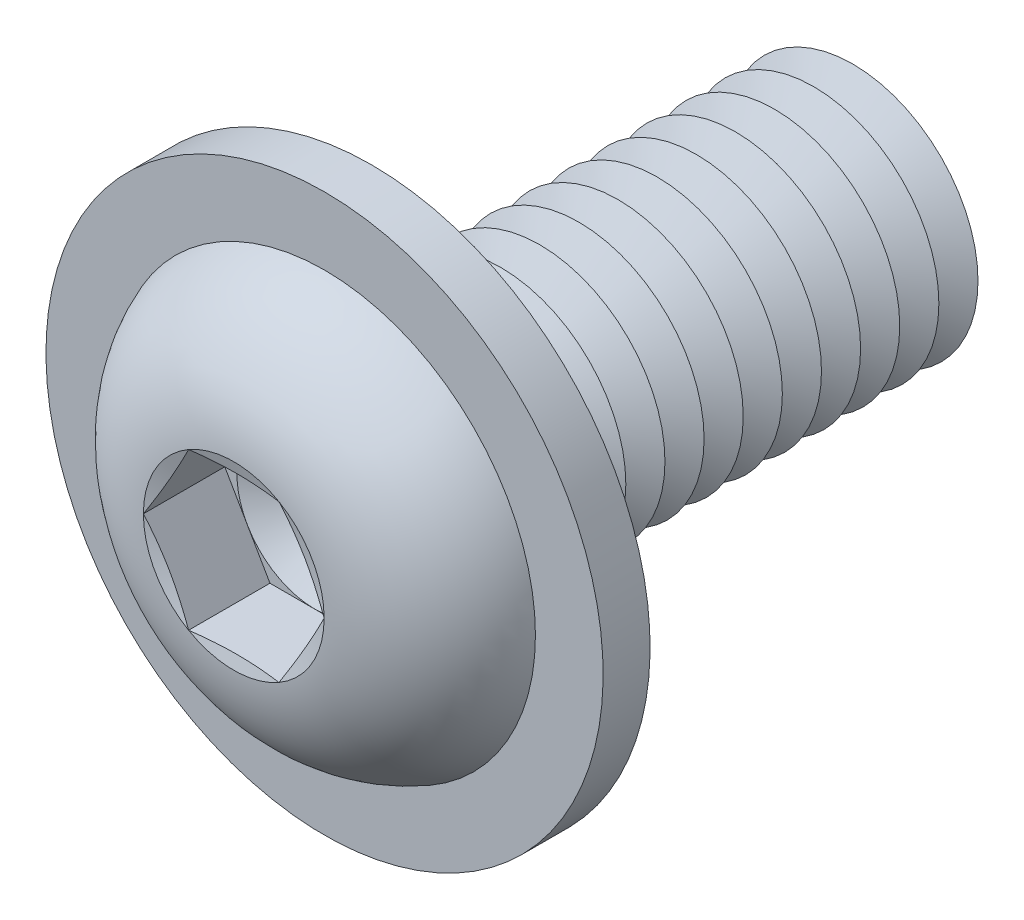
ISO-10303-21;
HEADER;
FILE_DESCRIPTION(('STEP AP214'),'2;1');
FILE_NAME('part.step','',(''),(''),'','','');
FILE_SCHEMA(('AUTOMOTIVE_DESIGN { 1 0 10303 214 1 1 1 1 }'));
ENDSEC;
DATA;
#1=APPLICATION_CONTEXT('core data for automotive mechanical design processes');
#2=APPLICATION_PROTOCOL_DEFINITION('international standard','automotive_design',2000,#1);
#3=PRODUCT_CONTEXT('',#1,'mechanical');
#4=PRODUCT('Part','Part','',(#3));
#5=PRODUCT_RELATED_PRODUCT_CATEGORY('part','',(#4));
#6=PRODUCT_DEFINITION_FORMATION('','',#4);
#7=PRODUCT_DEFINITION_CONTEXT('part definition',#1,'design');
#8=PRODUCT_DEFINITION('design','',#6,#7);
#9=PRODUCT_DEFINITION_SHAPE('','',#8);
#10=(LENGTH_UNIT() NAMED_UNIT(*) SI_UNIT(.MILLI.,.METRE.));
#11=(NAMED_UNIT(*) PLANE_ANGLE_UNIT() SI_UNIT($,.RADIAN.));
#12=(NAMED_UNIT(*) SI_UNIT($,.STERADIAN.) SOLID_ANGLE_UNIT());
#13=UNCERTAINTY_MEASURE_WITH_UNIT(LENGTH_MEASURE(1.E-05),#10,'distance_accuracy_value','');
#14=(GEOMETRIC_REPRESENTATION_CONTEXT(3) GLOBAL_UNCERTAINTY_ASSIGNED_CONTEXT((#13)) GLOBAL_UNIT_ASSIGNED_CONTEXT((#10,
#11,#12)) REPRESENTATION_CONTEXT('',''));
#15=CARTESIAN_POINT('',(0.,0.,0.));
#16=DIRECTION('',(0.,0.,1.));
#17=DIRECTION('',(1.,0.,0.));
#18=AXIS2_PLACEMENT_3D('',#15,#16,#17);
#19=CARTESIAN_POINT('',(0.,0.,-11.625));
#20=DIRECTION('',(0.,0.,1.));
#21=DIRECTION('',(1.,0.,0.));
#22=AXIS2_PLACEMENT_3D('',#19,#20,#21);
#23=CONICAL_SURFACE('',#22,4.,1.0471975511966);
#24=CARTESIAN_POINT('',(0.,0.,-12.25));
#25=DIRECTION('',(0.,0.,1.));
#26=DIRECTION('',(1.,0.,0.));
#27=AXIS2_PLACEMENT_3D('',#24,#25,#26);
#28=CIRCLE('',#27,2.91746824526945);
#29=CARTESIAN_POINT('',(2.91746824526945,0.,-12.25));
#30=VERTEX_POINT('',#29);
#31=EDGE_CURVE('E306',#30,#30,#28,.T.);
#32=ORIENTED_EDGE('',*,*,#31,.T.);
#33=EDGE_LOOP('',(#32));
#34=FACE_BOUND('',#33,.T.);
#35=CARTESIAN_POINT('',(0.,0.,-11.625));
#36=DIRECTION('',(0.,0.,1.));
#37=DIRECTION('',(1.,0.,0.));
#38=AXIS2_PLACEMENT_3D('',#35,#36,#37);
#39=CIRCLE('',#38,4.);
#40=CARTESIAN_POINT('',(4.,0.,-11.625));
#41=VERTEX_POINT('',#40);
#42=EDGE_CURVE('E302',#41,#41,#39,.T.);
#43=ORIENTED_EDGE('',*,*,#42,.F.);
#44=EDGE_LOOP('',(#43));
#45=FACE_BOUND('',#44,.T.);
#46=ADVANCED_FACE('F39',(#34,#45),#23,.T.);
#47=CARTESIAN_POINT('',(0.,0.,-12.25));
#48=DIRECTION('',(0.,0.,-1.));
#49=DIRECTION('',(-1.,0.,0.));
#50=AXIS2_PLACEMENT_3D('',#47,#48,#49);
#51=CONICAL_SURFACE('',#50,2.91746824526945,1.0471975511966);
#52=CARTESIAN_POINT('',(0.,0.,-12.875));
#53=DIRECTION('',(0.,0.,1.));
#54=DIRECTION('',(1.,0.,0.));
#55=AXIS2_PLACEMENT_3D('',#52,#53,#54);
#56=CIRCLE('',#55,4.);
#57=CARTESIAN_POINT('',(4.,0.,-12.875));
#58=VERTEX_POINT('',#57);
#59=EDGE_CURVE('E310',#58,#58,#56,.T.);
#60=ORIENTED_EDGE('',*,*,#59,.T.);
#61=EDGE_LOOP('',(#60));
#62=FACE_BOUND('',#61,.T.);
#63=ORIENTED_EDGE('',*,*,#31,.F.);
#64=EDGE_LOOP('',(#63));
#65=FACE_BOUND('',#64,.T.);
#66=ADVANCED_FACE('F434',(#62,#65),#51,.T.);
#67=CARTESIAN_POINT('',(0.,4.00000000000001,-16.));
#68=DIRECTION('',(0.,0.,-1.));
#69=DIRECTION('',(-1.,0.,0.));
#70=AXIS2_PLACEMENT_3D('',#67,#68,#69);
#71=PLANE('',#70);
#72=CARTESIAN_POINT('',(0.,0.,-16.));
#73=DIRECTION('',(0.,0.,1.));
#74=DIRECTION('',(1.,0.,0.));
#75=AXIS2_PLACEMENT_3D('',#72,#73,#74);
#76=CIRCLE('',#75,2.91746824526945);
#77=CARTESIAN_POINT('',(2.91746824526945,0.,-16.));
#78=VERTEX_POINT('',#77);
#79=EDGE_CURVE('E330',#78,#78,#76,.T.);
#80=ORIENTED_EDGE('',*,*,#79,.F.);
#81=EDGE_LOOP('',(#80));
#82=FACE_BOUND('',#81,.T.);
#83=ADVANCED_FACE('F440',(#82),#71,.T.);
#84=CARTESIAN_POINT('',(0.,0.,-15.375));
#85=DIRECTION('',(0.,0.,1.));
#86=DIRECTION('',(1.,0.,0.));
#87=AXIS2_PLACEMENT_3D('',#84,#85,#86);
#88=CONICAL_SURFACE('',#87,4.,1.0471975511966);
#89=ORIENTED_EDGE('',*,*,#79,.T.);
#90=EDGE_LOOP('',(#89));
#91=FACE_BOUND('',#90,.T.);
#92=CARTESIAN_POINT('',(0.,0.,-15.375));
#93=DIRECTION('',(0.,0.,1.));
#94=DIRECTION('',(1.,0.,0.));
#95=AXIS2_PLACEMENT_3D('',#92,#93,#94);
#96=CIRCLE('',#95,4.);
#97=CARTESIAN_POINT('',(4.,0.,-15.375));
#98=VERTEX_POINT('',#97);
#99=EDGE_CURVE('E326',#98,#98,#96,.T.);
#100=ORIENTED_EDGE('',*,*,#99,.F.);
#101=EDGE_LOOP('',(#100));
#102=FACE_BOUND('',#101,.T.);
#103=ADVANCED_FACE('F459',(#91,#102),#88,.T.);
#104=CARTESIAN_POINT('',(0.,0.,-14.75));
#105=DIRECTION('',(0.,0.,-1.));
#106=DIRECTION('',(-1.,0.,0.));
#107=AXIS2_PLACEMENT_3D('',#104,#105,#106);
#108=CONICAL_SURFACE('',#107,2.91746824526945,1.0471975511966);
#109=ORIENTED_EDGE('',*,*,#99,.T.);
#110=EDGE_LOOP('',(#109));
#111=FACE_BOUND('',#110,.T.);
#112=CARTESIAN_POINT('',(0.,0.,-14.75));
#113=DIRECTION('',(0.,0.,1.));
#114=DIRECTION('',(1.,0.,0.));
#115=AXIS2_PLACEMENT_3D('',#112,#113,#114);
#116=CIRCLE('',#115,2.91746824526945);
#117=CARTESIAN_POINT('',(2.91746824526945,0.,-14.75));
#118=VERTEX_POINT('',#117);
#119=EDGE_CURVE('E322',#118,#118,#116,.T.);
#120=ORIENTED_EDGE('',*,*,#119,.F.);
#121=EDGE_LOOP('',(#120));
#122=FACE_BOUND('',#121,.T.);
#123=ADVANCED_FACE('F456',(#111,#122),#108,.T.);
#124=CARTESIAN_POINT('',(0.,0.,-14.125));
#125=DIRECTION('',(0.,0.,1.));
#126=DIRECTION('',(1.,0.,0.));
#127=AXIS2_PLACEMENT_3D('',#124,#125,#126);
#128=CONICAL_SURFACE('',#127,4.,1.0471975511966);
#129=ORIENTED_EDGE('',*,*,#119,.T.);
#130=EDGE_LOOP('',(#129));
#131=FACE_BOUND('',#130,.T.);
#132=CARTESIAN_POINT('',(0.,0.,-14.125));
#133=DIRECTION('',(0.,0.,1.));
#134=DIRECTION('',(1.,0.,0.));
#135=AXIS2_PLACEMENT_3D('',#132,#133,#134);
#136=CIRCLE('',#135,4.);
#137=CARTESIAN_POINT('',(4.,0.,-14.125));
#138=VERTEX_POINT('',#137);
#139=EDGE_CURVE('E318',#138,#138,#136,.T.);
#140=ORIENTED_EDGE('',*,*,#139,.F.);
#141=EDGE_LOOP('',(#140));
#142=FACE_BOUND('',#141,.T.);
#143=ADVANCED_FACE('F450',(#131,#142),#128,.T.);
#144=CARTESIAN_POINT('',(0.,0.,-13.5));
#145=DIRECTION('',(0.,0.,-1.));
#146=DIRECTION('',(-1.,0.,0.));
#147=AXIS2_PLACEMENT_3D('',#144,#145,#146);
#148=CONICAL_SURFACE('',#147,2.91746824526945,1.0471975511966);
#149=ORIENTED_EDGE('',*,*,#139,.T.);
#150=EDGE_LOOP('',(#149));
#151=FACE_BOUND('',#150,.T.);
#152=CARTESIAN_POINT('',(0.,0.,-13.5));
#153=DIRECTION('',(0.,0.,1.));
#154=DIRECTION('',(1.,0.,0.));
#155=AXIS2_PLACEMENT_3D('',#152,#153,#154);
#156=CIRCLE('',#155,2.91746824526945);
#157=CARTESIAN_POINT('',(2.91746824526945,0.,-13.5));
#158=VERTEX_POINT('',#157);
#159=EDGE_CURVE('E314',#158,#158,#156,.T.);
#160=ORIENTED_EDGE('',*,*,#159,.F.);
#161=EDGE_LOOP('',(#160));
#162=FACE_BOUND('',#161,.T.);
#163=ADVANCED_FACE('F446',(#151,#162),#148,.T.);
#164=CARTESIAN_POINT('',(0.,0.,-12.875));
#165=DIRECTION('',(0.,0.,1.));
#166=DIRECTION('',(1.,0.,0.));
#167=AXIS2_PLACEMENT_3D('',#164,#165,#166);
#168=CONICAL_SURFACE('',#167,4.,1.0471975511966);
#169=ORIENTED_EDGE('',*,*,#159,.T.);
#170=EDGE_LOOP('',(#169));
#171=FACE_BOUND('',#170,.T.);
#172=ORIENTED_EDGE('',*,*,#59,.F.);
#173=EDGE_LOOP('',(#172));
#174=FACE_BOUND('',#173,.T.);
#175=ADVANCED_FACE('F449',(#171,#174),#168,.T.);
#176=CARTESIAN_POINT('',(0.,0.,-10.375));
#177=DIRECTION('',(0.,0.,1.));
#178=DIRECTION('',(1.,0.,0.));
#179=AXIS2_PLACEMENT_3D('',#176,#177,#178);
#180=CONICAL_SURFACE('',#179,4.,1.0471975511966);
#181=CARTESIAN_POINT('',(0.,0.,-11.));
#182=DIRECTION('',(0.,0.,1.));
#183=DIRECTION('',(1.,0.,0.));
#184=AXIS2_PLACEMENT_3D('',#181,#182,#183);
#185=CIRCLE('',#184,2.91746824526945);
#186=CARTESIAN_POINT('',(2.91746824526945,0.,-11.));
#187=VERTEX_POINT('',#186);
#188=EDGE_CURVE('E298',#187,#187,#185,.T.);
#189=ORIENTED_EDGE('',*,*,#188,.T.);
#190=EDGE_LOOP('',(#189));
#191=FACE_BOUND('',#190,.T.);
#192=CARTESIAN_POINT('',(0.,0.,-10.375));
#193=DIRECTION('',(0.,0.,1.));
#194=DIRECTION('',(1.,0.,0.));
#195=AXIS2_PLACEMENT_3D('',#192,#193,#194);
#196=CIRCLE('',#195,4.);
#197=CARTESIAN_POINT('',(4.,0.,-10.375));
#198=VERTEX_POINT('',#197);
#199=EDGE_CURVE('E294',#198,#198,#196,.T.);
#200=ORIENTED_EDGE('',*,*,#199,.F.);
#201=EDGE_LOOP('',(#200));
#202=FACE_BOUND('',#201,.T.);
#203=ADVANCED_FACE('F454',(#191,#202),#180,.T.);
#204=CARTESIAN_POINT('',(0.,0.,-11.));
#205=DIRECTION('',(0.,0.,-1.));
#206=DIRECTION('',(-1.,0.,0.));
#207=AXIS2_PLACEMENT_3D('',#204,#205,#206);
#208=CONICAL_SURFACE('',#207,2.91746824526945,1.0471975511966);
#209=ORIENTED_EDGE('',*,*,#42,.T.);
#210=EDGE_LOOP('',(#209));
#211=FACE_BOUND('',#210,.T.);
#212=ORIENTED_EDGE('',*,*,#188,.F.);
#213=EDGE_LOOP('',(#212));
#214=FACE_BOUND('',#213,.T.);
#215=ADVANCED_FACE('F505',(#211,#214),#208,.T.);
#216=CARTESIAN_POINT('',(0.,0.,-9.125));
#217=DIRECTION('',(0.,0.,1.));
#218=DIRECTION('',(1.,0.,0.));
#219=AXIS2_PLACEMENT_3D('',#216,#217,#218);
#220=CONICAL_SURFACE('',#219,4.,1.0471975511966);
#221=CARTESIAN_POINT('',(0.,0.,-9.75));
#222=DIRECTION('',(0.,0.,1.));
#223=DIRECTION('',(1.,0.,0.));
#224=AXIS2_PLACEMENT_3D('',#221,#222,#223);
#225=CIRCLE('',#224,2.91746824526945);
#226=CARTESIAN_POINT('',(2.91746824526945,0.,-9.75));
#227=VERTEX_POINT('',#226);
#228=EDGE_CURVE('E290',#227,#227,#225,.T.);
#229=ORIENTED_EDGE('',*,*,#228,.T.);
#230=EDGE_LOOP('',(#229));
#231=FACE_BOUND('',#230,.T.);
#232=CARTESIAN_POINT('',(0.,0.,-9.125));
#233=DIRECTION('',(0.,0.,1.));
#234=DIRECTION('',(1.,0.,0.));
#235=AXIS2_PLACEMENT_3D('',#232,#233,#234);
#236=CIRCLE('',#235,4.);
#237=CARTESIAN_POINT('',(4.,0.,-9.125));
#238=VERTEX_POINT('',#237);
#239=EDGE_CURVE('E286',#238,#238,#236,.T.);
#240=ORIENTED_EDGE('',*,*,#239,.F.);
#241=EDGE_LOOP('',(#240));
#242=FACE_BOUND('',#241,.T.);
#243=ADVANCED_FACE('F511',(#231,#242),#220,.T.);
#244=CARTESIAN_POINT('',(0.,0.,-9.75));
#245=DIRECTION('',(0.,0.,-1.));
#246=DIRECTION('',(-1.,0.,0.));
#247=AXIS2_PLACEMENT_3D('',#244,#245,#246);
#248=CONICAL_SURFACE('',#247,2.91746824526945,1.0471975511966);
#249=ORIENTED_EDGE('',*,*,#199,.T.);
#250=EDGE_LOOP('',(#249));
#251=FACE_BOUND('',#250,.T.);
#252=ORIENTED_EDGE('',*,*,#228,.F.);
#253=EDGE_LOOP('',(#252));
#254=FACE_BOUND('',#253,.T.);
#255=ADVANCED_FACE('F518',(#251,#254),#248,.T.);
#256=CARTESIAN_POINT('',(0.,0.,-7.875));
#257=DIRECTION('',(0.,0.,1.));
#258=DIRECTION('',(1.,0.,0.));
#259=AXIS2_PLACEMENT_3D('',#256,#257,#258);
#260=CONICAL_SURFACE('',#259,4.,1.0471975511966);
#261=CARTESIAN_POINT('',(0.,0.,-8.5));
#262=DIRECTION('',(0.,0.,1.));
#263=DIRECTION('',(1.,0.,0.));
#264=AXIS2_PLACEMENT_3D('',#261,#262,#263);
#265=CIRCLE('',#264,2.91746824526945);
#266=CARTESIAN_POINT('',(2.91746824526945,0.,-8.5));
#267=VERTEX_POINT('',#266);
#268=EDGE_CURVE('E282',#267,#267,#265,.T.);
#269=ORIENTED_EDGE('',*,*,#268,.T.);
#270=EDGE_LOOP('',(#269));
#271=FACE_BOUND('',#270,.T.);
#272=CARTESIAN_POINT('',(0.,0.,-7.875));
#273=DIRECTION('',(0.,0.,1.));
#274=DIRECTION('',(1.,0.,0.));
#275=AXIS2_PLACEMENT_3D('',#272,#273,#274);
#276=CIRCLE('',#275,4.);
#277=CARTESIAN_POINT('',(4.,0.,-7.875));
#278=VERTEX_POINT('',#277);
#279=EDGE_CURVE('E278',#278,#278,#276,.T.);
#280=ORIENTED_EDGE('',*,*,#279,.F.);
#281=EDGE_LOOP('',(#280));
#282=FACE_BOUND('',#281,.T.);
#283=ADVANCED_FACE('F525',(#271,#282),#260,.T.);
#284=CARTESIAN_POINT('',(0.,0.,-8.5));
#285=DIRECTION('',(0.,0.,-1.));
#286=DIRECTION('',(-1.,0.,0.));
#287=AXIS2_PLACEMENT_3D('',#284,#285,#286);
#288=CONICAL_SURFACE('',#287,2.91746824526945,1.0471975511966);
#289=ORIENTED_EDGE('',*,*,#239,.T.);
#290=EDGE_LOOP('',(#289));
#291=FACE_BOUND('',#290,.T.);
#292=ORIENTED_EDGE('',*,*,#268,.F.);
#293=EDGE_LOOP('',(#292));
#294=FACE_BOUND('',#293,.T.);
#295=ADVANCED_FACE('F532',(#291,#294),#288,.T.);
#296=CARTESIAN_POINT('',(0.,0.,-6.625));
#297=DIRECTION('',(0.,0.,1.));
#298=DIRECTION('',(1.,0.,0.));
#299=AXIS2_PLACEMENT_3D('',#296,#297,#298);
#300=CONICAL_SURFACE('',#299,4.,1.0471975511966);
#301=CARTESIAN_POINT('',(0.,0.,-7.25));
#302=DIRECTION('',(0.,0.,1.));
#303=DIRECTION('',(1.,0.,0.));
#304=AXIS2_PLACEMENT_3D('',#301,#302,#303);
#305=CIRCLE('',#304,2.91746824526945);
#306=CARTESIAN_POINT('',(2.91746824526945,0.,-7.25));
#307=VERTEX_POINT('',#306);
#308=EDGE_CURVE('E274',#307,#307,#305,.T.);
#309=ORIENTED_EDGE('',*,*,#308,.T.);
#310=EDGE_LOOP('',(#309));
#311=FACE_BOUND('',#310,.T.);
#312=CARTESIAN_POINT('',(0.,0.,-6.625));
#313=DIRECTION('',(0.,0.,1.));
#314=DIRECTION('',(1.,0.,0.));
#315=AXIS2_PLACEMENT_3D('',#312,#313,#314);
#316=CIRCLE('',#315,4.);
#317=CARTESIAN_POINT('',(4.,0.,-6.625));
#318=VERTEX_POINT('',#317);
#319=EDGE_CURVE('E270',#318,#318,#316,.T.);
#320=ORIENTED_EDGE('',*,*,#319,.F.);
#321=EDGE_LOOP('',(#320));
#322=FACE_BOUND('',#321,.T.);
#323=ADVANCED_FACE('F539',(#311,#322),#300,.T.);
#324=CARTESIAN_POINT('',(0.,0.,-7.25));
#325=DIRECTION('',(0.,0.,-1.));
#326=DIRECTION('',(-1.,0.,0.));
#327=AXIS2_PLACEMENT_3D('',#324,#325,#326);
#328=CONICAL_SURFACE('',#327,2.91746824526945,1.0471975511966);
#329=ORIENTED_EDGE('',*,*,#279,.T.);
#330=EDGE_LOOP('',(#329));
#331=FACE_BOUND('',#330,.T.);
#332=ORIENTED_EDGE('',*,*,#308,.F.);
#333=EDGE_LOOP('',(#332));
#334=FACE_BOUND('',#333,.T.);
#335=ADVANCED_FACE('F546',(#331,#334),#328,.T.);
#336=CARTESIAN_POINT('',(0.,0.,-5.375));
#337=DIRECTION('',(0.,0.,1.));
#338=DIRECTION('',(1.,0.,0.));
#339=AXIS2_PLACEMENT_3D('',#336,#337,#338);
#340=CONICAL_SURFACE('',#339,4.,1.0471975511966);
#341=CARTESIAN_POINT('',(0.,0.,-6.));
#342=DIRECTION('',(0.,0.,1.));
#343=DIRECTION('',(1.,0.,0.));
#344=AXIS2_PLACEMENT_3D('',#341,#342,#343);
#345=CIRCLE('',#344,2.91746824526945);
#346=CARTESIAN_POINT('',(2.91746824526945,0.,-6.));
#347=VERTEX_POINT('',#346);
#348=EDGE_CURVE('E266',#347,#347,#345,.T.);
#349=ORIENTED_EDGE('',*,*,#348,.T.);
#350=EDGE_LOOP('',(#349));
#351=FACE_BOUND('',#350,.T.);
#352=CARTESIAN_POINT('',(0.,0.,-5.375));
#353=DIRECTION('',(0.,0.,1.));
#354=DIRECTION('',(1.,0.,0.));
#355=AXIS2_PLACEMENT_3D('',#352,#353,#354);
#356=CIRCLE('',#355,4.);
#357=CARTESIAN_POINT('',(4.,0.,-5.375));
#358=VERTEX_POINT('',#357);
#359=EDGE_CURVE('E262',#358,#358,#356,.T.);
#360=ORIENTED_EDGE('',*,*,#359,.F.);
#361=EDGE_LOOP('',(#360));
#362=FACE_BOUND('',#361,.T.);
#363=ADVANCED_FACE('F553',(#351,#362),#340,.T.);
#364=CARTESIAN_POINT('',(0.,0.,-6.));
#365=DIRECTION('',(0.,0.,-1.));
#366=DIRECTION('',(-1.,0.,0.));
#367=AXIS2_PLACEMENT_3D('',#364,#365,#366);
#368=CONICAL_SURFACE('',#367,2.91746824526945,1.0471975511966);
#369=ORIENTED_EDGE('',*,*,#319,.T.);
#370=EDGE_LOOP('',(#369));
#371=FACE_BOUND('',#370,.T.);
#372=ORIENTED_EDGE('',*,*,#348,.F.);
#373=EDGE_LOOP('',(#372));
#374=FACE_BOUND('',#373,.T.);
#375=ADVANCED_FACE('F560',(#371,#374),#368,.T.);
#376=CARTESIAN_POINT('',(0.,0.,-4.125));
#377=DIRECTION('',(0.,0.,1.));
#378=DIRECTION('',(1.,0.,0.));
#379=AXIS2_PLACEMENT_3D('',#376,#377,#378);
#380=CONICAL_SURFACE('',#379,4.,1.0471975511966);
#381=CARTESIAN_POINT('',(0.,0.,-4.75));
#382=DIRECTION('',(0.,0.,1.));
#383=DIRECTION('',(1.,0.,0.));
#384=AXIS2_PLACEMENT_3D('',#381,#382,#383);
#385=CIRCLE('',#384,2.91746824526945);
#386=CARTESIAN_POINT('',(2.91746824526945,0.,-4.75));
#387=VERTEX_POINT('',#386);
#388=EDGE_CURVE('E258',#387,#387,#385,.T.);
#389=ORIENTED_EDGE('',*,*,#388,.T.);
#390=EDGE_LOOP('',(#389));
#391=FACE_BOUND('',#390,.T.);
#392=CARTESIAN_POINT('',(0.,0.,-4.125));
#393=DIRECTION('',(0.,0.,1.));
#394=DIRECTION('',(1.,0.,0.));
#395=AXIS2_PLACEMENT_3D('',#392,#393,#394);
#396=CIRCLE('',#395,4.);
#397=CARTESIAN_POINT('',(4.,0.,-4.125));
#398=VERTEX_POINT('',#397);
#399=EDGE_CURVE('E254',#398,#398,#396,.T.);
#400=ORIENTED_EDGE('',*,*,#399,.F.);
#401=EDGE_LOOP('',(#400));
#402=FACE_BOUND('',#401,.T.);
#403=ADVANCED_FACE('F567',(#391,#402),#380,.T.);
#404=CARTESIAN_POINT('',(0.,0.,-4.75));
#405=DIRECTION('',(0.,0.,-1.));
#406=DIRECTION('',(-1.,0.,0.));
#407=AXIS2_PLACEMENT_3D('',#404,#405,#406);
#408=CONICAL_SURFACE('',#407,2.91746824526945,1.0471975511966);
#409=ORIENTED_EDGE('',*,*,#359,.T.);
#410=EDGE_LOOP('',(#409));
#411=FACE_BOUND('',#410,.T.);
#412=ORIENTED_EDGE('',*,*,#388,.F.);
#413=EDGE_LOOP('',(#412));
#414=FACE_BOUND('',#413,.T.);
#415=ADVANCED_FACE('F574',(#411,#414),#408,.T.);
#416=CARTESIAN_POINT('',(0.,0.,-2.875));
#417=DIRECTION('',(0.,0.,1.));
#418=DIRECTION('',(1.,0.,0.));
#419=AXIS2_PLACEMENT_3D('',#416,#417,#418);
#420=CONICAL_SURFACE('',#419,4.,1.0471975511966);
#421=CARTESIAN_POINT('',(0.,0.,-3.5));
#422=DIRECTION('',(0.,0.,1.));
#423=DIRECTION('',(1.,0.,0.));
#424=AXIS2_PLACEMENT_3D('',#421,#422,#423);
#425=CIRCLE('',#424,2.91746824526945);
#426=CARTESIAN_POINT('',(2.91746824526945,0.,-3.5));
#427=VERTEX_POINT('',#426);
#428=EDGE_CURVE('E250',#427,#427,#425,.T.);
#429=ORIENTED_EDGE('',*,*,#428,.T.);
#430=EDGE_LOOP('',(#429));
#431=FACE_BOUND('',#430,.T.);
#432=CARTESIAN_POINT('',(0.,0.,-2.875));
#433=DIRECTION('',(0.,0.,1.));
#434=DIRECTION('',(1.,0.,0.));
#435=AXIS2_PLACEMENT_3D('',#432,#433,#434);
#436=CIRCLE('',#435,4.);
#437=CARTESIAN_POINT('',(4.,0.,-2.875));
#438=VERTEX_POINT('',#437);
#439=EDGE_CURVE('E242',#438,#438,#436,.T.);
#440=ORIENTED_EDGE('',*,*,#439,.F.);
#441=EDGE_LOOP('',(#440));
#442=FACE_BOUND('',#441,.T.);
#443=ADVANCED_FACE('F581',(#431,#442),#420,.T.);
#444=CARTESIAN_POINT('',(0.,0.,-3.5));
#445=DIRECTION('',(0.,0.,-1.));
#446=DIRECTION('',(-1.,0.,0.));
#447=AXIS2_PLACEMENT_3D('',#444,#445,#446);
#448=CONICAL_SURFACE('',#447,2.91746824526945,1.0471975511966);
#449=ORIENTED_EDGE('',*,*,#399,.T.);
#450=EDGE_LOOP('',(#449));
#451=FACE_BOUND('',#450,.T.);
#452=ORIENTED_EDGE('',*,*,#428,.F.);
#453=EDGE_LOOP('',(#452));
#454=FACE_BOUND('',#453,.T.);
#455=ADVANCED_FACE('F588',(#451,#454),#448,.T.);
#456=CARTESIAN_POINT('',(0.,0.,-1.625));
#457=DIRECTION('',(0.,0.,1.));
#458=DIRECTION('',(1.,0.,0.));
#459=AXIS2_PLACEMENT_3D('',#456,#457,#458);
#460=CONICAL_SURFACE('',#459,4.,1.0471975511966);
#461=CARTESIAN_POINT('',(0.,0.,-2.25));
#462=DIRECTION('',(0.,0.,1.));
#463=DIRECTION('',(1.,0.,0.));
#464=AXIS2_PLACEMENT_3D('',#461,#462,#463);
#465=CIRCLE('',#464,2.91746824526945);
#466=CARTESIAN_POINT('',(2.91746824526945,0.,-2.25));
#467=VERTEX_POINT('',#466);
#468=EDGE_CURVE('E231',#467,#467,#465,.T.);
#469=ORIENTED_EDGE('',*,*,#468,.T.);
#470=EDGE_LOOP('',(#469));
#471=FACE_BOUND('',#470,.T.);
#472=CARTESIAN_POINT('',(0.,0.,-1.625));
#473=DIRECTION('',(0.,0.,1.));
#474=DIRECTION('',(1.,0.,0.));
#475=AXIS2_PLACEMENT_3D('',#472,#473,#474);
#476=CIRCLE('',#475,4.);
#477=CARTESIAN_POINT('',(4.,0.,-1.625));
#478=VERTEX_POINT('',#477);
#479=EDGE_CURVE('E246',#478,#478,#476,.T.);
#480=ORIENTED_EDGE('',*,*,#479,.F.);
#481=EDGE_LOOP('',(#480));
#482=FACE_BOUND('',#481,.T.);
#483=ADVANCED_FACE('F595',(#471,#482),#460,.T.);
#484=CARTESIAN_POINT('',(0.,0.,-2.25));
#485=DIRECTION('',(0.,0.,-1.));
#486=DIRECTION('',(-1.,0.,0.));
#487=AXIS2_PLACEMENT_3D('',#484,#485,#486);
#488=CONICAL_SURFACE('',#487,2.91746824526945,1.0471975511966);
#489=ORIENTED_EDGE('',*,*,#439,.T.);
#490=EDGE_LOOP('',(#489));
#491=FACE_BOUND('',#490,.T.);
#492=ORIENTED_EDGE('',*,*,#468,.F.);
#493=EDGE_LOOP('',(#492));
#494=FACE_BOUND('',#493,.T.);
#495=ADVANCED_FACE('F220',(#491,#494),#488,.T.);
#496=CARTESIAN_POINT('',(0.,4.,0.));
#497=DIRECTION('',(0.,0.,-1.));
#498=DIRECTION('',(-1.,0.,0.));
#499=AXIS2_PLACEMENT_3D('',#496,#497,#498);
#500=PLANE('',#499);
#501=CARTESIAN_POINT('',(0.,0.,0.));
#502=DIRECTION('',(0.,0.,-1.));
#503=DIRECTION('',(-1.,0.,0.));
#504=AXIS2_PLACEMENT_3D('',#501,#502,#503);
#505=CIRCLE('',#504,4.625);
#506=CARTESIAN_POINT('',(-4.625,0.,0.));
#507=VERTEX_POINT('',#506);
#508=EDGE_CURVE('E344',#507,#507,#505,.F.);
#509=ORIENTED_EDGE('',*,*,#508,.T.);
#510=EDGE_LOOP('',(#509));
#511=FACE_BOUND('',#510,.T.);
#512=CARTESIAN_POINT('',(0.,0.,0.));
#513=DIRECTION('',(0.,0.,-1.));
#514=DIRECTION('',(0.,1.,0.));
#515=AXIS2_PLACEMENT_3D('',#512,#513,#514);
#516=CIRCLE('',#515,8.9);
#517=CARTESIAN_POINT('',(0.,8.9,0.));
#518=VERTEX_POINT('',#517);
#519=EDGE_CURVE('E926',#518,#518,#516,.T.);
#520=ORIENTED_EDGE('',*,*,#519,.T.);
#521=EDGE_LOOP('',(#520));
#522=FACE_BOUND('',#521,.T.);
#523=ADVANCED_FACE('F607',(#511,#522),#500,.T.);
#524=CARTESIAN_POINT('',(0.,0.,-0.624999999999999));
#525=DIRECTION('',(0.,0.,-1.));
#526=DIRECTION('',(-1.,0.,0.));
#527=AXIS2_PLACEMENT_3D('',#524,#525,#526);
#528=TOROIDAL_SURFACE('',#527,4.625,0.625);
#529=ORIENTED_EDGE('',*,*,#508,.F.);
#530=EDGE_LOOP('',(#529));
#531=FACE_BOUND('',#530,.T.);
#532=CARTESIAN_POINT('',(0.,0.,-0.624999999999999));
#533=DIRECTION('',(0.,0.,-1.));
#534=DIRECTION('',(-1.,0.,0.));
#535=AXIS2_PLACEMENT_3D('',#532,#533,#534);
#536=CIRCLE('',#535,4.);
#537=CARTESIAN_POINT('',(-4.,0.,-0.624999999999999));
#538=VERTEX_POINT('',#537);
#539=EDGE_CURVE('E339',#538,#538,#536,.T.);
#540=ORIENTED_EDGE('',*,*,#539,.F.);
#541=EDGE_LOOP('',(#540));
#542=FACE_BOUND('',#541,.T.);
#543=ADVANCED_FACE('F41',(#531,#542),#528,.F.);
#544=CARTESIAN_POINT('',(0.,0.,-16.));
#545=DIRECTION('',(0.,0.,-1.));
#546=DIRECTION('',(-1.,0.,0.));
#547=AXIS2_PLACEMENT_3D('',#544,#545,#546);
#548=CYLINDRICAL_SURFACE('',#547,4.);
#549=ORIENTED_EDGE('',*,*,#539,.T.);
#550=EDGE_LOOP('',(#549));
#551=FACE_BOUND('',#550,.T.);
#552=ORIENTED_EDGE('',*,*,#479,.T.);
#553=EDGE_LOOP('',(#552));
#554=FACE_BOUND('',#553,.T.);
#555=ADVANCED_FACE('F619',(#551,#554),#548,.T.);
#556=CARTESIAN_POINT('',(0.,0.,1.5));
#557=DIRECTION('',(0.,0.,-1.));
#558=DIRECTION('',(0.,1.,0.));
#559=AXIS2_PLACEMENT_3D('',#556,#557,#558);
#560=CYLINDRICAL_SURFACE('',#559,8.9);
#561=CARTESIAN_POINT('',(0.,0.,1.5));
#562=DIRECTION('',(0.,0.,-1.));
#563=DIRECTION('',(0.,1.,0.));
#564=AXIS2_PLACEMENT_3D('',#561,#562,#563);
#565=CIRCLE('',#564,8.9);
#566=CARTESIAN_POINT('',(0.,8.9,1.5));
#567=VERTEX_POINT('',#566);
#568=EDGE_CURVE('E928',#567,#567,#565,.T.);
#569=ORIENTED_EDGE('',*,*,#568,.T.);
#570=EDGE_LOOP('',(#569));
#571=FACE_BOUND('',#570,.T.);
#572=ORIENTED_EDGE('',*,*,#519,.F.);
#573=EDGE_LOOP('',(#572));
#574=FACE_BOUND('',#573,.T.);
#575=ADVANCED_FACE('F625',(#571,#574),#560,.T.);
#576=CARTESIAN_POINT('',(0.,0.,1.5));
#577=DIRECTION('',(0.,0.,-1.));
#578=DIRECTION('',(0.,1.,0.));
#579=AXIS2_PLACEMENT_3D('',#576,#577,#578);
#580=PLANE('',#579);
#581=CARTESIAN_POINT('',(0.,0.,1.5));
#582=DIRECTION('',(0.,0.,-1.));
#583=DIRECTION('',(0.,1.,0.));
#584=AXIS2_PLACEMENT_3D('',#581,#582,#583);
#585=CIRCLE('',#584,6.73705889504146);
#586=CARTESIAN_POINT('',(0.,6.73705889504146,1.5));
#587=VERTEX_POINT('',#586);
#588=EDGE_CURVE('E43',#587,#587,#585,.F.);
#589=ORIENTED_EDGE('',*,*,#588,.F.);
#590=EDGE_LOOP('',(#589));
#591=FACE_BOUND('',#590,.T.);
#592=ORIENTED_EDGE('',*,*,#568,.F.);
#593=EDGE_LOOP('',(#592));
#594=FACE_BOUND('',#593,.T.);
#595=ADVANCED_FACE('F117',(#591,#594),#580,.F.);
#596=CARTESIAN_POINT('',(0.,0.,1.8));
#597=DIRECTION('',(0.,0.,1.));
#598=DIRECTION('',(1.,0.,0.));
#599=AXIS2_PLACEMENT_3D('',#596,#597,#598);
#600=CONICAL_SURFACE('',#599,2.49999883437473,1.0471975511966);
#601=CARTESIAN_POINT('',(0.,0.,0.35662500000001));
#602=VERTEX_POINT('',#601);
#603=VERTEX_LOOP('',#602);
#604=FACE_BOUND('',#603,.T.);
#605=CARTESIAN_POINT('',(0.,0.,1.8));
#606=DIRECTION('',(0.,0.,1.));
#607=DIRECTION('',(1.,0.,0.));
#608=AXIS2_PLACEMENT_3D('',#605,#606,#607);
#609=CIRCLE('',#608,2.49999883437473);
#610=CARTESIAN_POINT('',(2.1650625,1.24999941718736,1.8));
#611=VERTEX_POINT('',#610);
#612=CARTESIAN_POINT('',(0.,2.49999883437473,1.8));
#613=VERTEX_POINT('',#612);
#614=EDGE_CURVE('E120',#611,#613,#609,.T.);
#615=ORIENTED_EDGE('',*,*,#614,.T.);
#616=CARTESIAN_POINT('',(0.,0.,1.8));
#617=DIRECTION('',(0.,0.,1.));
#618=DIRECTION('',(1.,0.,0.));
#619=AXIS2_PLACEMENT_3D('',#616,#617,#618);
#620=CIRCLE('',#619,2.49999883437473);
#621=CARTESIAN_POINT('',(-2.1650625,1.24999941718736,1.8));
#622=VERTEX_POINT('',#621);
#623=EDGE_CURVE('E11',#613,#622,#620,.T.);
#624=ORIENTED_EDGE('',*,*,#623,.T.);
#625=CARTESIAN_POINT('',(-2.1650625,-1.24999941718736,1.8));
#626=VERTEX_POINT('',#625);
#627=EDGE_CURVE('E49',#622,#626,#620,.T.);
#628=ORIENTED_EDGE('',*,*,#627,.T.);
#629=CARTESIAN_POINT('',(0.,-2.49999883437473,1.8));
#630=VERTEX_POINT('',#629);
#631=EDGE_CURVE('E350',#626,#630,#620,.T.);
#632=ORIENTED_EDGE('',*,*,#631,.T.);
#633=CARTESIAN_POINT('',(2.1650625,-1.24999941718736,1.8));
#634=VERTEX_POINT('',#633);
#635=EDGE_CURVE('E57',#630,#634,#620,.T.);
#636=ORIENTED_EDGE('',*,*,#635,.T.);
#637=EDGE_CURVE('E50',#634,#611,#620,.T.);
#638=ORIENTED_EDGE('',*,*,#637,.T.);
#639=EDGE_LOOP('',(#615,#624,#628,#632,#636,#638));
#640=FACE_BOUND('',#639,.T.);
#641=ADVANCED_FACE('F114',(#604,#640),#600,.F.);
#642=CARTESIAN_POINT('',(0.,0.,1.8));
#643=DIRECTION('',(0.,0.,1.));
#644=DIRECTION('',(1.,0.,0.));
#645=AXIS2_PLACEMENT_3D('',#642,#643,#644);
#646=PLANE('',#645);
#647=ORIENTED_EDGE('',*,*,#631,.F.);
#648=DIRECTION('',(0.5,-0.866025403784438,0.));
#649=VECTOR('',#648,1.);
#650=CARTESIAN_POINT('',(-2.88675,0.,1.8));
#651=LINE('',#650,#649);
#652=CARTESIAN_POINT('',(-1.443375,-2.49999883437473,1.8));
#653=VERTEX_POINT('',#652);
#654=EDGE_CURVE('E153',#626,#653,#651,.T.);
#655=ORIENTED_EDGE('',*,*,#654,.T.);
#656=DIRECTION('',(1.,0.,0.));
#657=VECTOR('',#656,1.);
#658=CARTESIAN_POINT('',(-1.443375,-2.49999883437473,1.8));
#659=LINE('',#658,#657);
#660=EDGE_CURVE('E159',#653,#630,#659,.T.);
#661=ORIENTED_EDGE('',*,*,#660,.T.);
#662=EDGE_LOOP('',(#647,#655,#661));
#663=FACE_BOUND('',#662,.T.);
#664=ADVANCED_FACE('F116',(#663),#646,.T.);
#665=ORIENTED_EDGE('',*,*,#635,.F.);
#666=CARTESIAN_POINT('',(1.443375,-2.49999883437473,1.8));
#667=VERTEX_POINT('',#666);
#668=EDGE_CURVE('E158',#630,#667,#659,.T.);
#669=ORIENTED_EDGE('',*,*,#668,.T.);
#670=DIRECTION('',(0.5,0.866025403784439,0.));
#671=VECTOR('',#670,1.);
#672=CARTESIAN_POINT('',(1.443375,-2.49999883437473,1.8));
#673=LINE('',#672,#671);
#674=EDGE_CURVE('E164',#667,#634,#673,.T.);
#675=ORIENTED_EDGE('',*,*,#674,.T.);
#676=EDGE_LOOP('',(#665,#669,#675));
#677=FACE_BOUND('',#676,.T.);
#678=ADVANCED_FACE('F646',(#677),#646,.T.);
#679=ORIENTED_EDGE('',*,*,#637,.F.);
#680=CARTESIAN_POINT('',(2.88675,0.,1.8));
#681=VERTEX_POINT('',#680);
#682=EDGE_CURVE('E163',#634,#681,#673,.T.);
#683=ORIENTED_EDGE('',*,*,#682,.T.);
#684=DIRECTION('',(-0.5,0.866025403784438,0.));
#685=VECTOR('',#684,1.);
#686=CARTESIAN_POINT('',(2.88675,0.,1.8));
#687=LINE('',#686,#685);
#688=EDGE_CURVE('E142',#681,#611,#687,.T.);
#689=ORIENTED_EDGE('',*,*,#688,.T.);
#690=EDGE_LOOP('',(#679,#683,#689));
#691=FACE_BOUND('',#690,.T.);
#692=ADVANCED_FACE('F651',(#691),#646,.T.);
#693=ORIENTED_EDGE('',*,*,#614,.F.);
#694=CARTESIAN_POINT('',(1.443375,2.49999883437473,1.8));
#695=VERTEX_POINT('',#694);
#696=EDGE_CURVE('E127',#611,#695,#687,.T.);
#697=ORIENTED_EDGE('',*,*,#696,.T.);
#698=DIRECTION('',(-1.,0.,0.));
#699=VECTOR('',#698,1.);
#700=CARTESIAN_POINT('',(1.443375,2.49999883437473,1.8));
#701=LINE('',#700,#699);
#702=EDGE_CURVE('E138',#695,#613,#701,.T.);
#703=ORIENTED_EDGE('',*,*,#702,.T.);
#704=EDGE_LOOP('',(#693,#697,#703));
#705=FACE_BOUND('',#704,.T.);
#706=ADVANCED_FACE('F144',(#705),#646,.T.);
#707=ORIENTED_EDGE('',*,*,#623,.F.);
#708=CARTESIAN_POINT('',(-1.443375,2.49999883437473,1.8));
#709=VERTEX_POINT('',#708);
#710=EDGE_CURVE('E133',#613,#709,#701,.T.);
#711=ORIENTED_EDGE('',*,*,#710,.T.);
#712=DIRECTION('',(-0.5,-0.866025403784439,0.));
#713=VECTOR('',#712,1.);
#714=CARTESIAN_POINT('',(-1.443375,2.49999883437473,1.8));
#715=LINE('',#714,#713);
#716=EDGE_CURVE('E136',#709,#622,#715,.T.);
#717=ORIENTED_EDGE('',*,*,#716,.T.);
#718=EDGE_LOOP('',(#707,#711,#717));
#719=FACE_BOUND('',#718,.T.);
#720=ADVANCED_FACE('F132',(#719),#646,.T.);
#721=ORIENTED_EDGE('',*,*,#627,.F.);
#722=CARTESIAN_POINT('',(-2.88675,0.,1.8));
#723=VERTEX_POINT('',#722);
#724=EDGE_CURVE('E146',#622,#723,#715,.T.);
#725=ORIENTED_EDGE('',*,*,#724,.T.);
#726=EDGE_CURVE('E154',#723,#626,#651,.T.);
#727=ORIENTED_EDGE('',*,*,#726,.T.);
#728=EDGE_LOOP('',(#721,#725,#727));
#729=FACE_BOUND('',#728,.T.);
#730=ADVANCED_FACE('F365',(#729),#646,.T.);
#731=CARTESIAN_POINT('',(-2.88675,0.,1.8));
#732=DIRECTION('',(-0.866025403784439,-0.5,0.));
#733=DIRECTION('',(0.5,-0.866025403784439,0.));
#734=AXIS2_PLACEMENT_3D('',#731,#732,#733);
#735=PLANE('',#734);
#736=CARTESIAN_POINT('',(-2.88686547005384,0.000200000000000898,4.40003094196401));
#737=CARTESIAN_POINT('',(-2.82691617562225,-0.103635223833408,4.3839595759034));
#738=CARTESIAN_POINT('',(-2.76685817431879,-0.207658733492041,4.36936933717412));
#739=CARTESIAN_POINT('',(-2.64653003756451,-0.416073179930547,4.3437355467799));
#740=CARTESIAN_POINT('',(-2.58625982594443,-0.520464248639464,4.33269343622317));
#741=CARTESIAN_POINT('',(-2.46587274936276,-0.728980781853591,4.31480063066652));
#742=CARTESIAN_POINT('',(-2.40575669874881,-0.833104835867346,4.3079285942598));
#743=CARTESIAN_POINT('',(-2.28544792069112,-1.0414857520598,4.29871388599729));
#744=CARTESIAN_POINT('',(-2.22525521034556,-1.14574258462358,4.29637033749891));
#745=CARTESIAN_POINT('',(-2.10486978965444,-1.35425624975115,4.29637033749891));
#746=CARTESIAN_POINT('',(-2.04467707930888,-1.45851308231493,4.29871388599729));
#747=CARTESIAN_POINT('',(-1.92436830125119,-1.66689399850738,4.3079285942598));
#748=CARTESIAN_POINT('',(-1.86425225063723,-1.77101805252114,4.31480063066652));
#749=CARTESIAN_POINT('',(-1.74386517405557,-1.97953458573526,4.33269343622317));
#750=CARTESIAN_POINT('',(-1.68359496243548,-2.08392565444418,4.3437355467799));
#751=CARTESIAN_POINT('',(-1.56326682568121,-2.29234010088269,4.36936933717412));
#752=CARTESIAN_POINT('',(-1.50320882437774,-2.39636361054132,4.3839595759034));
#753=CARTESIAN_POINT('',(-1.44325952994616,-2.50019883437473,4.40003094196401));
#754=B_SPLINE_CURVE_WITH_KNOTS('',3,(#736,#737,#738,#739,#740,#741,#742,#743,#744,#745,#746,
#747,#748,#749,#750,#751,#752,#753),.UNSPECIFIED.,.F.,.F.,(4,2,2,2,2,2,2,2,4),(0.,
0.362931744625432,0.726010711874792,1.08721550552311,1.44835036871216,1.8094852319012,
2.17069002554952,2.53376899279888,2.89670073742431),.UNSPECIFIED.);
#755=CARTESIAN_POINT('',(-2.88675,0.,4.4));
#756=VERTEX_POINT('',#755);
#757=CARTESIAN_POINT('',(-1.443375,-2.49999883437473,4.4));
#758=VERTEX_POINT('',#757);
#759=EDGE_CURVE('E370',#756,#758,#754,.T.);
#760=ORIENTED_EDGE('',*,*,#759,.T.);
#761=DIRECTION('',(0.,0.,1.));
#762=VECTOR('',#761,1.);
#763=CARTESIAN_POINT('',(-1.443375,-2.49999883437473,1.8));
#764=LINE('',#763,#762);
#765=EDGE_CURVE('E177',#653,#758,#764,.T.);
#766=ORIENTED_EDGE('',*,*,#765,.F.);
#767=ORIENTED_EDGE('',*,*,#654,.F.);
#768=ORIENTED_EDGE('',*,*,#726,.F.);
#769=DIRECTION('',(0.,0.,1.));
#770=VECTOR('',#769,1.);
#771=CARTESIAN_POINT('',(-2.88675,0.,1.8));
#772=LINE('',#771,#770);
#773=EDGE_CURVE('E181',#723,#756,#772,.T.);
#774=ORIENTED_EDGE('',*,*,#773,.T.);
#775=EDGE_LOOP('',(#760,#766,#767,#768,#774));
#776=FACE_BOUND('',#775,.T.);
#777=ADVANCED_FACE('F363',(#776),#735,.F.);
#778=CARTESIAN_POINT('',(-1.443375,-2.49999883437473,1.8));
#779=DIRECTION('',(0.,-1.,0.));
#780=DIRECTION('',(1.,0.,0.));
#781=AXIS2_PLACEMENT_3D('',#778,#779,#780);
#782=PLANE('',#781);
#783=CARTESIAN_POINT('',(-4.35611719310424,-2.49999883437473,4.97227902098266));
#784=CARTESIAN_POINT('',(-4.25066509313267,-2.49999883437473,4.94777440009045));
#785=CARTESIAN_POINT('',(-4.14516541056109,-2.49999883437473,4.92347459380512));
#786=CARTESIAN_POINT('',(-3.93405094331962,-2.49999883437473,4.87537247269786));
#787=CARTESIAN_POINT('',(-3.82843615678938,-2.49999883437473,4.85157016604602));
#788=CARTESIAN_POINT('',(-3.5113534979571,-2.49999883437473,4.78103338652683));
#789=CARTESIAN_POINT('',(-3.29968815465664,-2.49999883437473,4.73517861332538));
#790=CARTESIAN_POINT('',(-2.87365524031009,-2.49999883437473,4.64645582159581));
#791=CARTESIAN_POINT('',(-2.65928093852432,-2.49999883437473,4.60361983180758));
#792=CARTESIAN_POINT('',(-2.22952626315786,-2.49999883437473,4.52311285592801));
#793=CARTESIAN_POINT('',(-2.01414580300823,-2.49999883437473,4.48544232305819));
#794=CARTESIAN_POINT('',(-1.58798319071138,-2.49999883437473,4.41876559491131));
#795=CARTESIAN_POINT('',(-1.37723418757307,-2.49999883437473,4.38955265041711));
#796=CARTESIAN_POINT('',(-0.954530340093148,-2.49999883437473,4.34171384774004));
#797=CARTESIAN_POINT('',(-0.742575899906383,-2.49999883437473,4.32308463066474));
#798=CARTESIAN_POINT('',(-0.424544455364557,-2.49999883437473,4.30539140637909));
#799=CARTESIAN_POINT('',(-0.318745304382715,-2.49999883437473,4.30120018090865));
#800=CARTESIAN_POINT('',(-0.107062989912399,-2.49999883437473,4.29638997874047));
#801=CARTESIAN_POINT('',(-0.00117982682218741,-2.49999883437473,4.29577098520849));
#802=CARTESIAN_POINT('',(0.210552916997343,-2.49999883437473,4.29814378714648));
#803=CARTESIAN_POINT('',(0.316402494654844,-2.49999883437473,4.30113585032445));
#804=CARTESIAN_POINT('',(0.527944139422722,-2.49999883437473,4.31057322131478));
#805=CARTESIAN_POINT('',(0.633636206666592,-2.49999883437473,4.31701852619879));
#806=CARTESIAN_POINT('',(0.890304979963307,-2.49999883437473,4.33652018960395));
#807=CARTESIAN_POINT('',(1.0411561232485,-2.49999883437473,4.35122885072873));
#808=CARTESIAN_POINT('',(1.34222474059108,-2.49999883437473,4.38593609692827));
#809=CARTESIAN_POINT('',(1.49244223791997,-2.49999883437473,4.40593448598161));
#810=CARTESIAN_POINT('',(1.79273634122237,-2.49999883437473,4.45011321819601));
#811=CARTESIAN_POINT('',(1.94281100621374,-2.49999883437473,4.47430656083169));
#812=CARTESIAN_POINT('',(2.24242097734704,-2.49999883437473,4.52583552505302));
#813=CARTESIAN_POINT('',(2.39195625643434,-2.49999883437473,4.55317130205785));
#814=CARTESIAN_POINT('',(2.69364402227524,-2.49999883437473,4.61079781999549));
#815=CARTESIAN_POINT('',(2.8457870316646,-2.49999883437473,4.64113779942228));
#816=CARTESIAN_POINT('',(3.14969016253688,-2.49999883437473,4.70367638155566));
#817=CARTESIAN_POINT('',(3.30145027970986,-2.49999883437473,4.73587500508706));
#818=CARTESIAN_POINT('',(3.60383766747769,-2.49999883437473,4.80150275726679));
#819=CARTESIAN_POINT('',(3.75446660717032,-2.49999883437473,4.83492423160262));
#820=CARTESIAN_POINT('',(4.05546753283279,-2.49999883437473,4.90285814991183));
#821=CARTESIAN_POINT('',(4.2058395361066,-2.49999883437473,4.9373705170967));
#822=CARTESIAN_POINT('',(4.35611719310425,-2.49999883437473,4.97227902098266));
#823=B_SPLINE_CURVE_WITH_KNOTS('',3,(#783,#784,#785,#786,#787,#788,#789,#790,#791,#792,#793,
#794,#795,#796,#797,#798,#799,#800,#801,#802,#803,#804,#805,#806,#807,#808,#809,#810,#811,#812,
#813,#814,#815,#816,#817,#818,#819,#820,#821,#822),.UNSPECIFIED.,.F.,.F.,(4,2,2,2,2,2,2,2,2,2,2,
2,2,2,2,2,2,2,2,4),(0.,0.324785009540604,0.6495753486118,1.29928181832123,1.95507889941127,
2.61093348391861,3.24905289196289,3.88696967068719,4.204563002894,4.5221548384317,
4.83977022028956,5.15738533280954,5.61196030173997,6.06651842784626,6.52251118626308,
6.97852650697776,7.44392737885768,7.90933346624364,8.37220553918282,8.83504510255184),.UNSPECIFIED.);
#824=CARTESIAN_POINT('',(1.443375,-2.49999883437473,4.4));
#825=VERTEX_POINT('',#824);
#826=EDGE_CURVE('E376',#758,#825,#823,.T.);
#827=ORIENTED_EDGE('',*,*,#826,.T.);
#828=DIRECTION('',(0.,0.,1.));
#829=VECTOR('',#828,1.);
#830=CARTESIAN_POINT('',(1.443375,-2.49999883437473,1.8));
#831=LINE('',#830,#829);
#832=EDGE_CURVE('E173',#667,#825,#831,.T.);
#833=ORIENTED_EDGE('',*,*,#832,.F.);
#834=ORIENTED_EDGE('',*,*,#668,.F.);
#835=ORIENTED_EDGE('',*,*,#660,.F.);
#836=ORIENTED_EDGE('',*,*,#765,.T.);
#837=EDGE_LOOP('',(#827,#833,#834,#835,#836));
#838=FACE_BOUND('',#837,.T.);
#839=ADVANCED_FACE('F423',(#838),#782,.F.);
#840=CARTESIAN_POINT('',(1.443375,-2.49999883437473,1.8));
#841=DIRECTION('',(0.866025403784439,-0.5,0.));
#842=DIRECTION('',(0.5,0.866025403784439,0.));
#843=AXIS2_PLACEMENT_3D('',#840,#841,#842);
#844=PLANE('',#843);
#845=CARTESIAN_POINT('',(1.44325952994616,-2.50019883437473,4.40003094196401));
#846=CARTESIAN_POINT('',(1.50320882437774,-2.39636361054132,4.3839595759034));
#847=CARTESIAN_POINT('',(1.56326682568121,-2.29234010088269,4.36936933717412));
#848=CARTESIAN_POINT('',(1.68359496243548,-2.08392565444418,4.3437355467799));
#849=CARTESIAN_POINT('',(1.74386517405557,-1.97953458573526,4.33269343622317));
#850=CARTESIAN_POINT('',(1.86425225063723,-1.77101805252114,4.31480063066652));
#851=CARTESIAN_POINT('',(1.92436830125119,-1.66689399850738,4.3079285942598));
#852=CARTESIAN_POINT('',(2.04467707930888,-1.45851308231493,4.29871388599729));
#853=CARTESIAN_POINT('',(2.10486978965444,-1.35425624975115,4.29637033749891));
#854=CARTESIAN_POINT('',(2.22525521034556,-1.14574258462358,4.29637033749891));
#855=CARTESIAN_POINT('',(2.28544792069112,-1.0414857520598,4.29871388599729));
#856=CARTESIAN_POINT('',(2.40575669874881,-0.833104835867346,4.3079285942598));
#857=CARTESIAN_POINT('',(2.46587274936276,-0.728980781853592,4.31480063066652));
#858=CARTESIAN_POINT('',(2.58625982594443,-0.520464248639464,4.33269343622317));
#859=CARTESIAN_POINT('',(2.64653003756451,-0.416073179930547,4.3437355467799));
#860=CARTESIAN_POINT('',(2.76685817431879,-0.207658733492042,4.36936933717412));
#861=CARTESIAN_POINT('',(2.82691617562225,-0.103635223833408,4.3839595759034));
#862=CARTESIAN_POINT('',(2.88686547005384,0.000200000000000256,4.40003094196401));
#863=B_SPLINE_CURVE_WITH_KNOTS('',3,(#845,#846,#847,#848,#849,#850,#851,#852,#853,#854,#855,
#856,#857,#858,#859,#860,#861,#862),.UNSPECIFIED.,.F.,.F.,(4,2,2,2,2,2,2,2,4),(0.,
0.362931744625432,0.726010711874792,1.08721550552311,1.44835036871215,1.80948523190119,
2.17069002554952,2.53376899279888,2.89670073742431),.UNSPECIFIED.);
#864=CARTESIAN_POINT('',(2.88675,0.,4.4));
#865=VERTEX_POINT('',#864);
#866=EDGE_CURVE('E232',#825,#865,#863,.T.);
#867=ORIENTED_EDGE('',*,*,#866,.T.);
#868=DIRECTION('',(0.,0.,1.));
#869=VECTOR('',#868,1.);
#870=CARTESIAN_POINT('',(2.88675,0.,1.8));
#871=LINE('',#870,#869);
#872=EDGE_CURVE('E168',#681,#865,#871,.T.);
#873=ORIENTED_EDGE('',*,*,#872,.F.);
#874=ORIENTED_EDGE('',*,*,#682,.F.);
#875=ORIENTED_EDGE('',*,*,#674,.F.);
#876=ORIENTED_EDGE('',*,*,#832,.T.);
#877=EDGE_LOOP('',(#867,#873,#874,#875,#876));
#878=FACE_BOUND('',#877,.T.);
#879=ADVANCED_FACE('F218',(#878),#844,.F.);
#880=CARTESIAN_POINT('',(2.88675,0.,1.8));
#881=DIRECTION('',(0.866025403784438,0.5,0.));
#882=DIRECTION('',(-0.5,0.866025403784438,0.));
#883=AXIS2_PLACEMENT_3D('',#880,#881,#882);
#884=PLANE('',#883);
#885=CARTESIAN_POINT('',(2.88686547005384,-0.000199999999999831,4.40003094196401));
#886=CARTESIAN_POINT('',(2.82691617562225,0.103635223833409,4.3839595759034));
#887=CARTESIAN_POINT('',(2.76685817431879,0.207658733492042,4.36936933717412));
#888=CARTESIAN_POINT('',(2.64653003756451,0.416073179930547,4.3437355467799));
#889=CARTESIAN_POINT('',(2.58625982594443,0.520464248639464,4.33269343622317));
#890=CARTESIAN_POINT('',(2.46587274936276,0.728980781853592,4.31480063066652));
#891=CARTESIAN_POINT('',(2.40575669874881,0.833104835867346,4.3079285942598));
#892=CARTESIAN_POINT('',(2.28544792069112,1.0414857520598,4.29871388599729));
#893=CARTESIAN_POINT('',(2.22525521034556,1.14574258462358,4.29637033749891));
#894=CARTESIAN_POINT('',(2.10486978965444,1.35425624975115,4.29637033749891));
#895=CARTESIAN_POINT('',(2.04467707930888,1.45851308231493,4.29871388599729));
#896=CARTESIAN_POINT('',(1.92436830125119,1.66689399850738,4.3079285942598));
#897=CARTESIAN_POINT('',(1.86425225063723,1.77101805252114,4.31480063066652));
#898=CARTESIAN_POINT('',(1.74386517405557,1.97953458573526,4.33269343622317));
#899=CARTESIAN_POINT('',(1.68359496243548,2.08392565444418,4.3437355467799));
#900=CARTESIAN_POINT('',(1.56326682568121,2.29234010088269,4.36936933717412));
#901=CARTESIAN_POINT('',(1.50320882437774,2.39636361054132,4.3839595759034));
#902=CARTESIAN_POINT('',(1.44325952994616,2.50019883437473,4.40003094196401));
#903=B_SPLINE_CURVE_WITH_KNOTS('',3,(#885,#886,#887,#888,#889,#890,#891,#892,#893,#894,#895,
#896,#897,#898,#899,#900,#901,#902),.UNSPECIFIED.,.F.,.F.,(4,2,2,2,2,2,2,2,4),(0.,
0.362931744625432,0.726010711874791,1.08721550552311,1.44835036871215,1.80948523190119,
2.17069002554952,2.53376899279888,2.89670073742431),.UNSPECIFIED.);
#904=CARTESIAN_POINT('',(1.44337499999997,2.49999883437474,4.4));
#905=VERTEX_POINT('',#904);
#906=EDGE_CURVE('E223',#865,#905,#903,.T.);
#907=ORIENTED_EDGE('',*,*,#906,.T.);
#908=DIRECTION('',(0.,0.,1.));
#909=VECTOR('',#908,1.);
#910=CARTESIAN_POINT('',(1.443375,2.49999883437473,1.8));
#911=LINE('',#910,#909);
#912=EDGE_CURVE('E65',#695,#905,#911,.T.);
#913=ORIENTED_EDGE('',*,*,#912,.F.);
#914=ORIENTED_EDGE('',*,*,#696,.F.);
#915=ORIENTED_EDGE('',*,*,#688,.F.);
#916=ORIENTED_EDGE('',*,*,#872,.T.);
#917=EDGE_LOOP('',(#907,#913,#914,#915,#916));
#918=FACE_BOUND('',#917,.T.);
#919=ADVANCED_FACE('F212',(#918),#884,.F.);
#920=CARTESIAN_POINT('',(1.443375,2.49999883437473,1.8));
#921=DIRECTION('',(0.,1.,0.));
#922=DIRECTION('',(-1.,0.,0.));
#923=AXIS2_PLACEMENT_3D('',#920,#921,#922);
#924=PLANE('',#923);
#925=CARTESIAN_POINT('',(4.35611719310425,2.49999883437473,4.97227902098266));
#926=CARTESIAN_POINT('',(4.25066509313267,2.49999883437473,4.94777440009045));
#927=CARTESIAN_POINT('',(4.14516541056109,2.49999883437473,4.92347459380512));
#928=CARTESIAN_POINT('',(3.93405094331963,2.49999883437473,4.87537247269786));
#929=CARTESIAN_POINT('',(3.82843615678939,2.49999883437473,4.85157016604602));
#930=CARTESIAN_POINT('',(3.51135349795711,2.49999883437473,4.78103338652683));
#931=CARTESIAN_POINT('',(3.29968815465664,2.49999883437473,4.73517861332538));
#932=CARTESIAN_POINT('',(2.87365524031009,2.49999883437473,4.64645582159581));
#933=CARTESIAN_POINT('',(2.65928093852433,2.49999883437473,4.60361983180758));
#934=CARTESIAN_POINT('',(2.22952626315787,2.49999883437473,4.52311285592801));
#935=CARTESIAN_POINT('',(2.01414580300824,2.49999883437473,4.48544232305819));
#936=CARTESIAN_POINT('',(1.58798319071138,2.49999883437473,4.41876559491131));
#937=CARTESIAN_POINT('',(1.37723418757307,2.49999883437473,4.38955265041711));
#938=CARTESIAN_POINT('',(0.95453034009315,2.49999883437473,4.34171384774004));
#939=CARTESIAN_POINT('',(0.742575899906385,2.49999883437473,4.32308463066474));
#940=CARTESIAN_POINT('',(0.424544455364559,2.49999883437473,4.30539140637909));
#941=CARTESIAN_POINT('',(0.318745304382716,2.49999883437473,4.30120018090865));
#942=CARTESIAN_POINT('',(0.107062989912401,2.49999883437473,4.29638997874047));
#943=CARTESIAN_POINT('',(0.00117982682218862,2.49999883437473,4.29577098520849));
#944=CARTESIAN_POINT('',(-0.210552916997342,2.49999883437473,4.29814378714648));
#945=CARTESIAN_POINT('',(-0.316402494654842,2.49999883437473,4.30113585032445));
#946=CARTESIAN_POINT('',(-0.52794413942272,2.49999883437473,4.31057322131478));
#947=CARTESIAN_POINT('',(-0.633636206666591,2.49999883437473,4.31701852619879));
#948=CARTESIAN_POINT('',(-0.890304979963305,2.49999883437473,4.33652018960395));
#949=CARTESIAN_POINT('',(-1.0411561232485,2.49999883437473,4.35122885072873));
#950=CARTESIAN_POINT('',(-1.34222474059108,2.49999883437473,4.38593609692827));
#951=CARTESIAN_POINT('',(-1.49244223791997,2.49999883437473,4.40593448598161));
#952=CARTESIAN_POINT('',(-1.79273634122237,2.49999883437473,4.45011321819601));
#953=CARTESIAN_POINT('',(-1.94281100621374,2.49999883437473,4.47430656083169));
#954=CARTESIAN_POINT('',(-2.24242097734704,2.49999883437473,4.52583552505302));
#955=CARTESIAN_POINT('',(-2.39195625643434,2.49999883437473,4.55317130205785));
#956=CARTESIAN_POINT('',(-2.69364402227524,2.49999883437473,4.61079781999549));
#957=CARTESIAN_POINT('',(-2.8457870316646,2.49999883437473,4.64113779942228));
#958=CARTESIAN_POINT('',(-3.14969016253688,2.49999883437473,4.70367638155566));
#959=CARTESIAN_POINT('',(-3.30145027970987,2.49999883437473,4.73587500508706));
#960=CARTESIAN_POINT('',(-3.60383766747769,2.49999883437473,4.80150275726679));
#961=CARTESIAN_POINT('',(-3.75446660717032,2.49999883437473,4.83492423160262));
#962=CARTESIAN_POINT('',(-4.05546753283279,2.49999883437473,4.90285814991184));
#963=CARTESIAN_POINT('',(-4.2058395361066,2.49999883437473,4.9373705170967));
#964=CARTESIAN_POINT('',(-4.35611719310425,2.49999883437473,4.97227902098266));
#965=B_SPLINE_CURVE_WITH_KNOTS('',3,(#925,#926,#927,#928,#929,#930,#931,#932,#933,#934,#935,
#936,#937,#938,#939,#940,#941,#942,#943,#944,#945,#946,#947,#948,#949,#950,#951,#952,#953,#954,
#955,#956,#957,#958,#959,#960,#961,#962,#963,#964),.UNSPECIFIED.,.F.,.F.,(4,2,2,2,2,2,2,2,2,2,2,
2,2,2,2,2,2,2,2,4),(0.,0.324785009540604,0.6495753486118,1.29928181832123,1.95507889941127,
2.61093348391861,3.24905289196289,3.88696967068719,4.204563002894,4.5221548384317,
4.83977022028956,5.15738533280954,5.61196030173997,6.06651842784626,6.52251118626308,
6.97852650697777,7.44392737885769,7.90933346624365,8.37220553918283,8.83504510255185),.UNSPECIFIED.);
#966=CARTESIAN_POINT('',(-1.443375,2.49999883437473,4.4));
#967=VERTEX_POINT('',#966);
#968=EDGE_CURVE('E172',#905,#967,#965,.T.);
#969=ORIENTED_EDGE('',*,*,#968,.T.);
#970=DIRECTION('',(0.,0.,1.));
#971=VECTOR('',#970,1.);
#972=CARTESIAN_POINT('',(-1.443375,2.49999883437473,1.8));
#973=LINE('',#972,#971);
#974=EDGE_CURVE('E140',#709,#967,#973,.T.);
#975=ORIENTED_EDGE('',*,*,#974,.F.);
#976=ORIENTED_EDGE('',*,*,#710,.F.);
#977=ORIENTED_EDGE('',*,*,#702,.F.);
#978=ORIENTED_EDGE('',*,*,#912,.T.);
#979=EDGE_LOOP('',(#969,#975,#976,#977,#978));
#980=FACE_BOUND('',#979,.T.);
#981=ADVANCED_FACE('F137',(#980),#924,.F.);
#982=CARTESIAN_POINT('',(-1.443375,2.49999883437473,1.8));
#983=DIRECTION('',(-0.866025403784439,0.5,0.));
#984=DIRECTION('',(-0.5,-0.866025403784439,0.));
#985=AXIS2_PLACEMENT_3D('',#982,#983,#984);
#986=PLANE('',#985);
#987=CARTESIAN_POINT('',(-1.44325952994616,2.50019883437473,4.40003094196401));
#988=CARTESIAN_POINT('',(-1.50320882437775,2.39636361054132,4.3839595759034));
#989=CARTESIAN_POINT('',(-1.56326682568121,2.29234010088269,4.36936933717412));
#990=CARTESIAN_POINT('',(-1.68359496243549,2.08392565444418,4.3437355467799));
#991=CARTESIAN_POINT('',(-1.74386517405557,1.97953458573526,4.33269343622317));
#992=CARTESIAN_POINT('',(-1.86425225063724,1.77101805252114,4.31480063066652));
#993=CARTESIAN_POINT('',(-1.92436830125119,1.66689399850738,4.3079285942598));
#994=CARTESIAN_POINT('',(-2.04467707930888,1.45851308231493,4.29871388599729));
#995=CARTESIAN_POINT('',(-2.10486978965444,1.35425624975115,4.29637033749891));
#996=CARTESIAN_POINT('',(-2.22525521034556,1.14574258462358,4.29637033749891));
#997=CARTESIAN_POINT('',(-2.28544792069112,1.0414857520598,4.29871388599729));
#998=CARTESIAN_POINT('',(-2.40575669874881,0.833104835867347,4.3079285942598));
#999=CARTESIAN_POINT('',(-2.46587274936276,0.728980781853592,4.31480063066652));
#1000=CARTESIAN_POINT('',(-2.58625982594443,0.520464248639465,4.33269343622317));
#1001=CARTESIAN_POINT('',(-2.64653003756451,0.416073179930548,4.3437355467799));
#1002=CARTESIAN_POINT('',(-2.76685817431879,0.207658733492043,4.36936933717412));
#1003=CARTESIAN_POINT('',(-2.82691617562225,0.103635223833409,4.3839595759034));
#1004=CARTESIAN_POINT('',(-2.88686547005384,-0.000199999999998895,4.40003094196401));
#1005=B_SPLINE_CURVE_WITH_KNOTS('',3,(#987,#988,#989,#990,#991,#992,#993,#994,#995,#996,#997,
#998,#999,#1000,#1001,#1002,#1003,#1004),.UNSPECIFIED.,.F.,.F.,(4,2,2,2,2,2,2,2,4),(0.,
0.362931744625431,0.726010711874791,1.08721550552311,1.44835036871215,1.80948523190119,
2.17069002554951,2.53376899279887,2.89670073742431),.UNSPECIFIED.);
#1006=EDGE_CURVE('E197',#967,#756,#1005,.T.);
#1007=ORIENTED_EDGE('',*,*,#1006,.T.);
#1008=ORIENTED_EDGE('',*,*,#773,.F.);
#1009=ORIENTED_EDGE('',*,*,#724,.F.);
#1010=ORIENTED_EDGE('',*,*,#716,.F.);
#1011=ORIENTED_EDGE('',*,*,#974,.T.);
#1012=EDGE_LOOP('',(#1007,#1008,#1009,#1010,#1011));
#1013=FACE_BOUND('',#1012,.T.);
#1014=ADVANCED_FACE('F211',(#1013),#986,.F.);
#1015=CARTESIAN_POINT('',(0.,0.,4.4));
#1016=DIRECTION('',(0.,0.,1.));
#1017=DIRECTION('',(1.,0.,0.));
#1018=AXIS2_PLACEMENT_3D('',#1015,#1016,#1017);
#1019=CONICAL_SURFACE('',#1018,2.88675,1.30899693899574);
#1020=ORIENTED_EDGE('',*,*,#759,.F.);
#1021=CARTESIAN_POINT('',(0.,0.,4.4));
#1022=DIRECTION('',(0.,0.,-1.));
#1023=DIRECTION('',(-1.,0.,0.));
#1024=AXIS2_PLACEMENT_3D('',#1021,#1022,#1023);
#1025=CIRCLE('',#1024,2.88675);
#1026=EDGE_CURVE('E334',#758,#756,#1025,.T.);
#1027=ORIENTED_EDGE('',*,*,#1026,.F.);
#1028=EDGE_LOOP('',(#1020,#1027));
#1029=FACE_BOUND('',#1028,.T.);
#1030=ADVANCED_FACE('F374',(#1029),#1019,.F.);
#1031=ORIENTED_EDGE('',*,*,#826,.F.);
#1032=EDGE_CURVE('E384',#825,#758,#1025,.T.);
#1033=ORIENTED_EDGE('',*,*,#1032,.F.);
#1034=EDGE_LOOP('',(#1031,#1033));
#1035=FACE_BOUND('',#1034,.T.);
#1036=ADVANCED_FACE('F409',(#1035),#1019,.F.);
#1037=ORIENTED_EDGE('',*,*,#866,.F.);
#1038=EDGE_CURVE('E397',#865,#825,#1025,.T.);
#1039=ORIENTED_EDGE('',*,*,#1038,.F.);
#1040=EDGE_LOOP('',(#1037,#1039));
#1041=FACE_BOUND('',#1040,.T.);
#1042=ADVANCED_FACE('F403',(#1041),#1019,.F.);
#1043=ORIENTED_EDGE('',*,*,#906,.F.);
#1044=EDGE_CURVE('E395',#905,#865,#1025,.T.);
#1045=ORIENTED_EDGE('',*,*,#1044,.F.);
#1046=EDGE_LOOP('',(#1043,#1045));
#1047=FACE_BOUND('',#1046,.T.);
#1048=ADVANCED_FACE('F718',(#1047),#1019,.F.);
#1049=ORIENTED_EDGE('',*,*,#968,.F.);
#1050=EDGE_CURVE('E340',#967,#905,#1025,.T.);
#1051=ORIENTED_EDGE('',*,*,#1050,.F.);
#1052=EDGE_LOOP('',(#1049,#1051));
#1053=FACE_BOUND('',#1052,.T.);
#1054=ADVANCED_FACE('F204',(#1053),#1019,.F.);
#1055=ORIENTED_EDGE('',*,*,#1006,.F.);
#1056=EDGE_CURVE('E335',#756,#967,#1025,.T.);
#1057=ORIENTED_EDGE('',*,*,#1056,.F.);
#1058=EDGE_LOOP('',(#1055,#1057));
#1059=FACE_BOUND('',#1058,.T.);
#1060=ADVANCED_FACE('F387',(#1059),#1019,.F.);
#1061=CARTESIAN_POINT('',(0.,0.,0.));
#1062=DIRECTION('',(0.,0.,-1.));
#1063=DIRECTION('',(-1.,0.,0.));
#1064=AXIS2_PLACEMENT_3D('',#1061,#1062,#1063);
#1065=DEGENERATE_TOROIDAL_SURFACE('',#1064,2.59000479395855,4.40999520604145,.T.);
#1066=ORIENTED_EDGE('',*,*,#1056,.T.);
#1067=ORIENTED_EDGE('',*,*,#1050,.T.);
#1068=ORIENTED_EDGE('',*,*,#1044,.T.);
#1069=ORIENTED_EDGE('',*,*,#1038,.T.);
#1070=ORIENTED_EDGE('',*,*,#1032,.T.);
#1071=ORIENTED_EDGE('',*,*,#1026,.T.);
#1072=EDGE_LOOP('',(#1066,#1067,#1068,#1069,#1070,#1071));
#1073=FACE_BOUND('',#1072,.T.);
#1074=ORIENTED_EDGE('',*,*,#588,.T.);
#1075=EDGE_LOOP('',(#1074));
#1076=FACE_BOUND('',#1075,.T.);
#1077=ADVANCED_FACE('F379',(#1073,#1076),#1065,.T.);
#1078=CLOSED_SHELL('',(#46,#66,#83,#103,#123,#143,#163,#175,#203,#215,#243,#255,#283,#295,#323,
#335,#363,#375,#403,#415,#443,#455,#483,#495,#523,#543,#555,#575,#595,#641,#664,#678,#692,#706,
#720,#730,#777,#839,#879,#919,#981,#1014,#1030,#1036,#1042,#1048,#1054,#1060,#1077));
#1079=MANIFOLD_SOLID_BREP('B2',#1078);
#1080=ADVANCED_BREP_SHAPE_REPRESENTATION('',(#18,#1079),#14);
#1081=SHAPE_DEFINITION_REPRESENTATION(#9,#1080);
ENDSEC;
END-ISO-10303-21;
